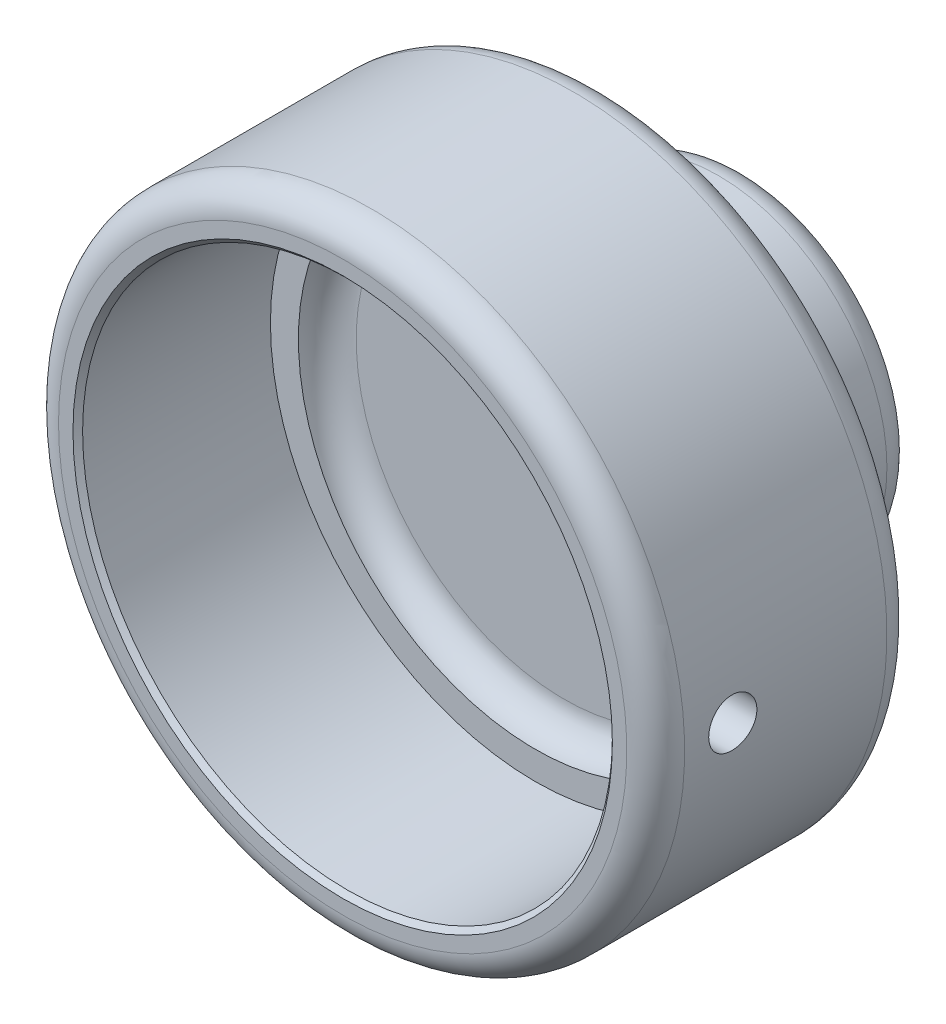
ISO-10303-21;
HEADER;
FILE_DESCRIPTION(('STEP AP214'),'2;1');
FILE_NAME('part.step','',(''),(''),'','','');
FILE_SCHEMA(('AUTOMOTIVE_DESIGN { 1 0 10303 214 1 1 1 1 }'));
ENDSEC;
DATA;
#1=APPLICATION_CONTEXT('core data for automotive mechanical design processes');
#2=APPLICATION_PROTOCOL_DEFINITION('international standard','automotive_design',2000,#1);
#3=PRODUCT_CONTEXT('',#1,'mechanical');
#4=PRODUCT('Part','Part','',(#3));
#5=PRODUCT_RELATED_PRODUCT_CATEGORY('part','',(#4));
#6=PRODUCT_DEFINITION_FORMATION('','',#4);
#7=PRODUCT_DEFINITION_CONTEXT('part definition',#1,'design');
#8=PRODUCT_DEFINITION('design','',#6,#7);
#9=PRODUCT_DEFINITION_SHAPE('','',#8);
#10=(LENGTH_UNIT() NAMED_UNIT(*) SI_UNIT(.MILLI.,.METRE.));
#11=(NAMED_UNIT(*) PLANE_ANGLE_UNIT() SI_UNIT($,.RADIAN.));
#12=(NAMED_UNIT(*) SI_UNIT($,.STERADIAN.) SOLID_ANGLE_UNIT());
#13=UNCERTAINTY_MEASURE_WITH_UNIT(LENGTH_MEASURE(1.E-05),#10,'distance_accuracy_value','');
#14=(GEOMETRIC_REPRESENTATION_CONTEXT(3) GLOBAL_UNCERTAINTY_ASSIGNED_CONTEXT((#13)) GLOBAL_UNIT_ASSIGNED_CONTEXT((#10,
#11,#12)) REPRESENTATION_CONTEXT('',''));
#15=CARTESIAN_POINT('',(0.,0.,0.));
#16=DIRECTION('',(0.,0.,1.));
#17=DIRECTION('',(1.,0.,0.));
#18=AXIS2_PLACEMENT_3D('',#15,#16,#17);
#19=CARTESIAN_POINT('',(0.,0.,56.3932145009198));
#20=DIRECTION('',(0.,0.,1.));
#21=DIRECTION('',(0.,-1.,0.));
#22=AXIS2_PLACEMENT_3D('',#19,#20,#21);
#23=CYLINDRICAL_SURFACE('',#22,27.5);
#24=CARTESIAN_POINT('',(0.,0.,21.9999999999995));
#25=DIRECTION('',(0.,0.,1.));
#26=DIRECTION('',(1.,0.,0.));
#27=AXIS2_PLACEMENT_3D('',#24,#25,#26);
#28=CIRCLE('',#27,27.5);
#29=CARTESIAN_POINT('',(27.5,0.,21.9999999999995));
#30=VERTEX_POINT('',#29);
#31=EDGE_CURVE('E139',#30,#30,#28,.T.);
#32=ORIENTED_EDGE('',*,*,#31,.F.);
#33=EDGE_LOOP('',(#32));
#34=FACE_BOUND('',#33,.T.);
#35=CARTESIAN_POINT('',(0.,0.,41.4999999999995));
#36=DIRECTION('',(0.,0.,-1.));
#37=DIRECTION('',(0.,1.,0.));
#38=AXIS2_PLACEMENT_3D('',#35,#36,#37);
#39=CIRCLE('',#38,27.5);
#40=CARTESIAN_POINT('',(0.,27.5,41.4999999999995));
#41=VERTEX_POINT('',#40);
#42=EDGE_CURVE('E154',#41,#41,#39,.F.);
#43=ORIENTED_EDGE('',*,*,#42,.T.);
#44=EDGE_LOOP('',(#43));
#45=FACE_BOUND('',#44,.T.);
#46=CARTESIAN_POINT('',(27.5,-1.94289029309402E-13,36.4999999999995));
#47=CARTESIAN_POINT('',(27.4999985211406,-0.140115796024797,36.4999939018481));
#48=CARTESIAN_POINT('',(27.4989177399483,-0.280325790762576,36.4881808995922));
#49=CARTESIAN_POINT('',(27.4947102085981,-0.556863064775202,36.4412323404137));
#50=CARTESIAN_POINT('',(27.4915811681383,-0.693185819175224,36.4060706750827));
#51=CARTESIAN_POINT('',(27.4836305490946,-0.957903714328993,36.3134529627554));
#52=CARTESIAN_POINT('',(27.4788099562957,-1.08630342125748,36.2560098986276));
#53=CARTESIAN_POINT('',(27.4680161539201,-1.33160898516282,36.1204840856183));
#54=CARTESIAN_POINT('',(27.462043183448,-1.44851721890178,36.0424056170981));
#55=CARTESIAN_POINT('',(27.4495943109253,-1.66790186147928,35.8675729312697));
#56=CARTESIAN_POINT('',(27.4431171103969,-1.77033896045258,35.770769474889));
#57=CARTESIAN_POINT('',(27.430400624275,-1.95753596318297,35.561339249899));
#58=CARTESIAN_POINT('',(27.4241613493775,-2.04229507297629,35.4487117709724));
#59=CARTESIAN_POINT('',(27.4126135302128,-2.19186610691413,35.2105887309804));
#60=CARTESIAN_POINT('',(27.4073066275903,-2.25664299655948,35.0850710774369));
#61=CARTESIAN_POINT('',(27.3982398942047,-2.36418706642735,34.8248842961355));
#62=CARTESIAN_POINT('',(27.394480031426,-2.40695470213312,34.6902153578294));
#63=CARTESIAN_POINT('',(27.3889444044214,-2.46915102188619,34.4159460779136));
#64=CARTESIAN_POINT('',(27.3871631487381,-2.48864431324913,34.2763605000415));
#65=CARTESIAN_POINT('',(27.3857692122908,-2.50393824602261,33.9958882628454));
#66=CARTESIAN_POINT('',(27.3861564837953,-2.49973940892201,33.8550016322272));
#67=CARTESIAN_POINT('',(27.3890508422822,-2.46782160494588,33.5763704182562));
#68=CARTESIAN_POINT('',(27.3915515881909,-2.4401729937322,33.4386177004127));
#69=CARTESIAN_POINT('',(27.398381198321,-2.36224986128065,33.1697161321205));
#70=CARTESIAN_POINT('',(27.4027100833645,-2.31197508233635,33.0385673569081));
#71=CARTESIAN_POINT('',(27.4127155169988,-2.19014843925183,32.7863731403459));
#72=CARTESIAN_POINT('',(27.4183940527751,-2.11856516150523,32.6653429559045));
#73=CARTESIAN_POINT('',(27.4304571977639,-1.95617612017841,32.4369884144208));
#74=CARTESIAN_POINT('',(27.4368418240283,-1.86536989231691,32.3296643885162));
#75=CARTESIAN_POINT('',(27.4496259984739,-1.66671871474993,32.1313597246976));
#76=CARTESIAN_POINT('',(27.4560255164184,-1.5588129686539,32.0404399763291));
#77=CARTESIAN_POINT('',(27.4680963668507,-1.32923747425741,31.8779960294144));
#78=CARTESIAN_POINT('',(27.4737676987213,-1.20756771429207,31.8064718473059));
#79=CARTESIAN_POINT('',(27.483744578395,-0.953877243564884,31.6848525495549));
#80=CARTESIAN_POINT('',(27.4880499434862,-0.821855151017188,31.6347603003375));
#81=CARTESIAN_POINT('',(27.494807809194,-0.551226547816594,31.5574702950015));
#82=CARTESIAN_POINT('',(27.4972603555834,-0.412620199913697,31.5302719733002));
#83=CARTESIAN_POINT('',(27.5000303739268,-0.133285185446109,31.4996186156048));
#84=CARTESIAN_POINT('',(27.5003554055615,0.00743418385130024,31.496079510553));
#85=CARTESIAN_POINT('',(27.4988539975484,0.287464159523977,31.5126245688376));
#86=CARTESIAN_POINT('',(27.497027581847,0.426774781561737,31.532708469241));
#87=CARTESIAN_POINT('',(27.4914334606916,0.699791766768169,31.595859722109));
#88=CARTESIAN_POINT('',(27.48766906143,0.833507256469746,31.6388879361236));
#89=CARTESIAN_POINT('',(27.4786216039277,1.09182141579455,31.7466663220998));
#90=CARTESIAN_POINT('',(27.4733385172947,1.21641991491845,31.8114169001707));
#91=CARTESIAN_POINT('',(27.4618265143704,1.4533447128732,31.9610120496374));
#92=CARTESIAN_POINT('',(27.4555950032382,1.56563584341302,32.0459121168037));
#93=CARTESIAN_POINT('',(27.4428944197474,1.77440294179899,32.2333163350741));
#94=CARTESIAN_POINT('',(27.436425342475,1.8708785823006,32.3358208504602));
#95=CARTESIAN_POINT('',(27.4239561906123,2.04556601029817,32.5558899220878));
#96=CARTESIAN_POINT('',(27.4179575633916,2.12372280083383,32.6734982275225));
#97=CARTESIAN_POINT('',(27.4071297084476,2.25917642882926,32.9202195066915));
#98=CARTESIAN_POINT('',(27.4023004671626,2.3164735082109,33.0493323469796));
#99=CARTESIAN_POINT('',(27.3943667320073,2.40848827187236,33.3152055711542));
#100=CARTESIAN_POINT('',(27.3912596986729,2.44323921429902,33.4519543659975));
#101=CARTESIAN_POINT('',(27.3871139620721,2.48928337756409,33.7293754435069));
#102=CARTESIAN_POINT('',(27.386075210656,2.50057714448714,33.8700476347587));
#103=CARTESIAN_POINT('',(27.3861844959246,2.49937951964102,34.1507757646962));
#104=CARTESIAN_POINT('',(27.3873245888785,2.48697452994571,34.2908320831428));
#105=CARTESIAN_POINT('',(27.3916462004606,2.43891212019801,34.5668629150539));
#106=CARTESIAN_POINT('',(27.394827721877,2.40325466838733,34.7028374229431));
#107=CARTESIAN_POINT('',(27.4028715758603,2.3097222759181,34.9668476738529));
#108=CARTESIAN_POINT('',(27.4077337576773,2.25184932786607,35.0948841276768));
#109=CARTESIAN_POINT('',(27.4185913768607,2.11553802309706,35.3394387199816));
#110=CARTESIAN_POINT('',(27.424586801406,2.03709989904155,35.4559569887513));
#111=CARTESIAN_POINT('',(27.4370614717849,1.86155995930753,35.674610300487));
#112=CARTESIAN_POINT('',(27.443542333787,1.76439393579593,35.7766937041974));
#113=CARTESIAN_POINT('',(27.4562428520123,1.55427847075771,35.9631476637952));
#114=CARTESIAN_POINT('',(27.4624624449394,1.441325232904,36.0475139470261));
#115=CARTESIAN_POINT('',(27.4739530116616,1.20258414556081,36.1962748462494));
#116=CARTESIAN_POINT('',(27.4792219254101,1.07676932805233,36.2606263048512));
#117=CARTESIAN_POINT('',(27.4881941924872,0.816155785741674,36.3672062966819));
#118=CARTESIAN_POINT('',(27.4918993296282,0.681367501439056,36.4094600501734));
#119=CARTESIAN_POINT('',(27.4963841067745,0.45483141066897,36.4599810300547));
#120=CARTESIAN_POINT('',(27.4977338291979,0.364536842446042,36.4749679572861));
#121=CARTESIAN_POINT('',(27.4995422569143,0.182841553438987,36.4949794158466));
#122=CARTESIAN_POINT('',(27.5000009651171,0.0914408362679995,36.5000039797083));
#123=CARTESIAN_POINT('',(27.5,-1.94289029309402E-13,36.4999999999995));
#124=B_SPLINE_CURVE_WITH_KNOTS('',3,(#46,#47,#48,#49,#50,#51,#52,#53,#54,#55,#56,#57,#58,#59,
#60,#61,#62,#63,#64,#65,#66,#67,#68,#69,#70,#71,#72,#73,#74,#75,#76,#77,#78,#79,#80,#81,#82,#83,
#84,#85,#86,#87,#88,#89,#90,#91,#92,#93,#94,#95,#96,#97,#98,#99,#100,#101,#102,#103,#104,#105,
#106,#107,#108,#109,#110,#111,#112,#113,#114,#115,#116,#117,#118,#119,#120,#121,#122,#123),
.UNSPECIFIED.,.T.,.F.,(4,2,2,2,2,2,2,2,2,2,2,2,2,2,2,2,2,2,2,2,2,2,2,2,2,2,2,2,2,2,2,2,2,2,2,2,
2,2,4),(0.,0.420013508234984,0.840497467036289,1.26073678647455,1.68088900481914,
2.10216145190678,2.52345281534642,2.94547867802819,3.36749580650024,3.78833871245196,
4.20917235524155,4.62874783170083,5.04832808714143,5.46852998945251,5.88874204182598,
6.31048311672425,6.73222454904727,7.15402236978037,7.57580976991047,7.99609761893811,
8.41638079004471,8.83594932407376,9.25552570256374,9.67627137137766,10.097025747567,
10.5190275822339,10.9410245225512,11.3623975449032,11.7837607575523,12.2035906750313,
12.6234211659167,13.0432140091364,13.4630021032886,13.8842558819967,14.3056111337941,
14.7278687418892,15.1496433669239,15.4237488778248,15.6978534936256),.UNSPECIFIED.);
#125=CARTESIAN_POINT('',(27.5,-1.94289029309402E-13,36.4999999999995));
#126=VERTEX_POINT('',#125);
#127=EDGE_CURVE('E69',#126,#126,#124,.T.);
#128=ORIENTED_EDGE('',*,*,#127,.T.);
#129=EDGE_LOOP('',(#128));
#130=FACE_BOUND('',#129,.T.);
#131=ADVANCED_FACE('F12',(#34,#45,#130),#23,.F.);
#132=CARTESIAN_POINT('',(0.,-1.94289029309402E-13,17.9999999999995));
#133=DIRECTION('',(0.,0.,-1.));
#134=DIRECTION('',(-1.,0.,0.));
#135=AXIS2_PLACEMENT_3D('',#132,#133,#134);
#136=CYLINDRICAL_SURFACE('',#135,32.5);
#137=CARTESIAN_POINT('',(0.,-1.94289029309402E-13,17.9999999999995));
#138=DIRECTION('',(0.,0.,-1.));
#139=DIRECTION('',(-1.,0.,0.));
#140=AXIS2_PLACEMENT_3D('',#137,#138,#139);
#141=CIRCLE('',#140,32.5);
#142=CARTESIAN_POINT('',(-32.5,-1.94289029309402E-13,17.9999999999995));
#143=VERTEX_POINT('',#142);
#144=EDGE_CURVE('E210',#143,#143,#141,.T.);
#145=ORIENTED_EDGE('',*,*,#144,.F.);
#146=EDGE_LOOP('',(#145));
#147=FACE_BOUND('',#146,.T.);
#148=CARTESIAN_POINT('',(0.,-1.94289029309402E-13,38.9999999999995));
#149=DIRECTION('',(0.,0.,-1.));
#150=DIRECTION('',(-1.,0.,0.));
#151=AXIS2_PLACEMENT_3D('',#148,#149,#150);
#152=CIRCLE('',#151,32.5);
#153=CARTESIAN_POINT('',(-32.5,-1.94289029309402E-13,38.9999999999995));
#154=VERTEX_POINT('',#153);
#155=EDGE_CURVE('E206',#154,#154,#152,.T.);
#156=ORIENTED_EDGE('',*,*,#155,.T.);
#157=EDGE_LOOP('',(#156));
#158=FACE_BOUND('',#157,.T.);
#159=CARTESIAN_POINT('',(32.5,-1.94289029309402E-13,36.4999999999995));
#160=CARTESIAN_POINT('',(32.4999987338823,0.14020372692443,36.4999938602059));
#161=CARTESIAN_POINT('',(32.4990830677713,0.280503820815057,36.4881660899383));
#162=CARTESIAN_POINT('',(32.4955183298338,0.557224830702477,36.4411554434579));
#163=CARTESIAN_POINT('',(32.4928672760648,0.693641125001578,36.4059458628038));
#164=CARTESIAN_POINT('',(32.4861314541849,0.958546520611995,36.3131934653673));
#165=CARTESIAN_POINT('',(32.4820474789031,1.08703995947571,36.2556629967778));
#166=CARTESIAN_POINT('',(32.4729042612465,1.33251463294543,36.1199233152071));
#167=CARTESIAN_POINT('',(32.4678452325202,1.44949838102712,36.041718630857));
#168=CARTESIAN_POINT('',(32.4573075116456,1.66892129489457,35.8666645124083));
#169=CARTESIAN_POINT('',(32.4518280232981,1.77133176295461,35.7697791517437));
#170=CARTESIAN_POINT('',(32.4410736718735,1.9584550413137,35.560189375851));
#171=CARTESIAN_POINT('',(32.4357988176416,2.04316708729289,35.4474842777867));
#172=CARTESIAN_POINT('',(32.4260421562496,2.19258379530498,35.2092833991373));
#173=CARTESIAN_POINT('',(32.4215613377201,2.25726358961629,35.0837719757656));
#174=CARTESIAN_POINT('',(32.413908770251,2.36462086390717,34.8236304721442));
#175=CARTESIAN_POINT('',(32.4107370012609,2.40729868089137,34.6890005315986));
#176=CARTESIAN_POINT('',(32.406068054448,2.46935819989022,34.4147284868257));
#177=CARTESIAN_POINT('',(32.4045675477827,2.48878621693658,34.275096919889));
#178=CARTESIAN_POINT('',(32.4034003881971,2.50393769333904,33.9945472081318));
#179=CARTESIAN_POINT('',(32.4037337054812,2.49966153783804,33.8536290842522));
#180=CARTESIAN_POINT('',(32.406193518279,2.46756437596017,33.5748231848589));
#181=CARTESIAN_POINT('',(32.4083161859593,2.43979362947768,33.436929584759));
#182=CARTESIAN_POINT('',(32.4141095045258,2.36157363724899,33.1677667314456));
#183=CARTESIAN_POINT('',(32.4177801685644,2.31112419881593,33.0364975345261));
#184=CARTESIAN_POINT('',(32.4262602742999,2.18892235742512,32.7841491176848));
#185=CARTESIAN_POINT('',(32.4310709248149,2.11714732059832,32.663080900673));
#186=CARTESIAN_POINT('',(32.4412877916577,1.9543480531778,32.4346914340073));
#187=CARTESIAN_POINT('',(32.4466940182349,1.86332349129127,32.3273704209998));
#188=CARTESIAN_POINT('',(32.4575098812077,1.66432673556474,32.1292295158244));
#189=CARTESIAN_POINT('',(32.4629194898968,1.55631107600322,32.0384532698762));
#190=CARTESIAN_POINT('',(32.4731191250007,1.32655017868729,31.8763158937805));
#191=CARTESIAN_POINT('',(32.4779091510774,1.20480493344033,31.8049547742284));
#192=CARTESIAN_POINT('',(32.486330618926,0.951013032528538,31.6836763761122));
#193=CARTESIAN_POINT('',(32.4899619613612,0.818965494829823,31.6337609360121));
#194=CARTESIAN_POINT('',(32.4956557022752,0.548329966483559,31.5568208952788));
#195=CARTESIAN_POINT('',(32.4977181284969,0.409742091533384,31.5297958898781));
#196=CARTESIAN_POINT('',(32.5000380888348,0.130338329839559,31.4994583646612));
#197=CARTESIAN_POINT('',(32.5003002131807,-0.0104709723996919,31.4960855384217));
#198=CARTESIAN_POINT('',(32.4990022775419,-0.290653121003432,31.5129902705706));
#199=CARTESIAN_POINT('',(32.4974422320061,-0.430025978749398,31.5332676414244));
#200=CARTESIAN_POINT('',(32.4926784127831,-0.703207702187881,31.5968472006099));
#201=CARTESIAN_POINT('',(32.4894766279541,-0.837023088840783,31.6401215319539));
#202=CARTESIAN_POINT('',(32.4817891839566,-1.0954930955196,31.7484382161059));
#203=CARTESIAN_POINT('',(32.4773035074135,-1.22014759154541,31.8134808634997));
#204=CARTESIAN_POINT('',(32.4675400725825,-1.4570323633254,31.9636400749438));
#205=CARTESIAN_POINT('',(32.4622607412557,-1.56923717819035,32.0487967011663));
#206=CARTESIAN_POINT('',(32.4515087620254,-1.77778073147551,32.2367085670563));
#207=CARTESIAN_POINT('',(32.4460361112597,-1.87411923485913,32.3394640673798));
#208=CARTESIAN_POINT('',(32.43550079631,-2.04840146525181,32.5599180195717));
#209=CARTESIAN_POINT('',(32.4304390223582,-2.12630591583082,32.677647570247));
#210=CARTESIAN_POINT('',(32.4213107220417,-2.26123953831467,32.9245524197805));
#211=CARTESIAN_POINT('',(32.417244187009,-2.31826889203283,33.0537276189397));
#212=CARTESIAN_POINT('',(32.410571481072,-2.40976618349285,33.3197164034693));
#213=CARTESIAN_POINT('',(32.4079637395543,-2.4442583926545,33.4565215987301));
#214=CARTESIAN_POINT('',(32.4044984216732,-2.48978139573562,33.7340024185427));
#215=CARTESIAN_POINT('',(32.4036408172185,-2.50081256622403,33.8746779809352));
#216=CARTESIAN_POINT('',(32.4037731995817,-2.49909627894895,34.1555159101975));
#217=CARTESIAN_POINT('',(32.4047583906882,-2.48641054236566,34.2956786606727));
#218=CARTESIAN_POINT('',(32.4084551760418,-2.43774899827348,34.5718769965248));
#219=CARTESIAN_POINT('',(32.4111667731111,-2.40177315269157,34.7079125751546));
#220=CARTESIAN_POINT('',(32.4180095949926,-2.30756771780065,34.9720006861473));
#221=CARTESIAN_POINT('',(32.422140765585,-2.24933897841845,35.1000535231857));
#222=CARTESIAN_POINT('',(32.4313572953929,-2.11228792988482,35.3445754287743));
#223=CARTESIAN_POINT('',(32.4364426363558,-2.03346601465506,35.4610447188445));
#224=CARTESIAN_POINT('',(32.4470101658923,-1.85723474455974,35.6794087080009));
#225=CARTESIAN_POINT('',(32.4524933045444,-1.75977991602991,35.7812666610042));
#226=CARTESIAN_POINT('',(32.4632300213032,-1.5491270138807,35.9672176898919));
#227=CARTESIAN_POINT('',(32.4684835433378,-1.43592512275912,36.0513064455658));
#228=CARTESIAN_POINT('',(32.4781771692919,-1.19680393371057,36.1994273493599));
#229=CARTESIAN_POINT('',(32.4826159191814,-1.07086399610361,36.2634262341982));
#230=CARTESIAN_POINT('',(32.4901633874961,-0.810079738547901,36.3692890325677));
#231=CARTESIAN_POINT('',(32.4932736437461,-0.67524592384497,36.4111785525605));
#232=CARTESIAN_POINT('',(32.4970095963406,-0.449672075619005,36.460890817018));
#233=CARTESIAN_POINT('',(32.4981259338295,-0.360385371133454,36.4755374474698));
#234=CARTESIAN_POINT('',(32.499621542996,-0.180745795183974,36.4950940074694));
#235=CARTESIAN_POINT('',(32.5000008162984,-0.0903929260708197,36.5000039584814));
#236=CARTESIAN_POINT('',(32.5,-1.94289029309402E-13,36.4999999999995));
#237=B_SPLINE_CURVE_WITH_KNOTS('',3,(#159,#160,#161,#162,#163,#164,#165,#166,#167,#168,#169,
#170,#171,#172,#173,#174,#175,#176,#177,#178,#179,#180,#181,#182,#183,#184,#185,#186,#187,#188,
#189,#190,#191,#192,#193,#194,#195,#196,#197,#198,#199,#200,#201,#202,#203,#204,#205,#206,#207,
#208,#209,#210,#211,#212,#213,#214,#215,#216,#217,#218,#219,#220,#221,#222,#223,#224,#225,#226,
#227,#228,#229,#230,#231,#232,#233,#234,#235,#236),.UNSPECIFIED.,.T.,.F.,(4,2,2,2,2,2,2,2,2,2,2,
2,2,2,2,2,2,2,2,2,2,2,2,2,2,2,2,2,2,2,2,2,2,2,2,2,2,2,4),(0.,0.420281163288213,
0.841043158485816,1.26157271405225,1.68201022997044,2.10326454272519,2.52453704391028,
2.94633042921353,3.36811735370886,3.78906264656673,4.21000109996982,4.63004134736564,
5.05008516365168,5.47057639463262,5.89107486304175,6.31266706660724,6.73425950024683,
7.1558880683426,7.57750918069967,7.99805488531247,8.41859725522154,8.83863136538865,
9.25867116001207,9.67955473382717,10.1004445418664,10.5222232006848,10.9439981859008,
11.3653181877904,11.7866314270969,12.2068497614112,12.6270687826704,13.0472717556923,
13.4674666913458,13.8887005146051,14.3100366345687,14.7320667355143,15.1536069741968,
15.4245735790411,15.6955395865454),.UNSPECIFIED.);
#238=CARTESIAN_POINT('',(32.5,-1.94289029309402E-13,36.4999999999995));
#239=VERTEX_POINT('',#238);
#240=EDGE_CURVE('E42',#239,#239,#237,.T.);
#241=ORIENTED_EDGE('',*,*,#240,.T.);
#242=EDGE_LOOP('',(#241));
#243=FACE_BOUND('',#242,.T.);
#244=ADVANCED_FACE('F80',(#147,#158,#243),#136,.T.);
#245=CARTESIAN_POINT('',(0.,-1.94289029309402E-13,52.8204584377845));
#246=DIRECTION('',(0.,0.,1.));
#247=DIRECTION('',(1.,0.,0.));
#248=AXIS2_PLACEMENT_3D('',#245,#246,#247);
#249=CYLINDRICAL_SURFACE('',#248,17.5);
#250=CARTESIAN_POINT('',(0.,-17.5,10.5));
#251=CARTESIAN_POINT('',(0.139663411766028,-17.499997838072,10.499994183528));
#252=CARTESIAN_POINT('',(0.279409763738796,-17.4983105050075,10.4882569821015));
#253=CARTESIAN_POINT('',(0.555001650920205,-17.4917417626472,10.441627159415));
#254=CARTESIAN_POINT('',(0.690843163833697,-17.4868571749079,10.406711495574));
#255=CARTESIAN_POINT('',(0.954596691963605,-17.4744432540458,10.3147848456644));
#256=CARTESIAN_POINT('',(1.08251442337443,-17.4669158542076,10.2577900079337));
#257=CARTESIAN_POINT('',(1.32694912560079,-17.4500497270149,10.1233611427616));
#258=CARTESIAN_POINT('',(1.44346778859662,-17.4407112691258,10.045930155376));
#259=CARTESIAN_POINT('',(1.66264662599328,-17.4211884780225,9.87223957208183));
#260=CARTESIAN_POINT('',(1.76521397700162,-17.4109991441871,9.77586339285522));
#261=CARTESIAN_POINT('',(1.95277822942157,-17.3909624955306,9.56726896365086));
#262=CARTESIAN_POINT('',(2.03777415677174,-17.3811151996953,9.4550498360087));
#263=CARTESIAN_POINT('',(2.18813969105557,-17.3628289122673,9.21733720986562));
#264=CARTESIAN_POINT('',(2.25342031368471,-17.3543963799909,9.09178688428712));
#265=CARTESIAN_POINT('',(2.36193362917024,-17.3399620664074,8.83136365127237));
#266=CARTESIAN_POINT('',(2.40516741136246,-17.3339601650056,8.6964912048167));
#267=CARTESIAN_POINT('',(2.46807330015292,-17.325115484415,8.42222497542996));
#268=CARTESIAN_POINT('',(2.48790372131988,-17.3222514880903,8.28286820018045));
#269=CARTESIAN_POINT('',(2.50393025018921,-17.3199423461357,8.00277773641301));
#270=CARTESIAN_POINT('',(2.50012759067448,-17.3204970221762,7.8620441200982));
#271=CARTESIAN_POINT('',(2.46912545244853,-17.3249431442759,7.58430863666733));
#272=CARTESIAN_POINT('',(2.44210170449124,-17.3288095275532,7.44728669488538));
#273=CARTESIAN_POINT('',(2.36569930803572,-17.3394042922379,7.17974228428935));
#274=CARTESIAN_POINT('',(2.31632008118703,-17.3461327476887,7.04921998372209));
#275=CARTESIAN_POINT('',(2.19642380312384,-17.3617214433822,6.79784181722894));
#276=CARTESIAN_POINT('',(2.12583173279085,-17.3705892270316,6.6770222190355));
#277=CARTESIAN_POINT('',(1.96556711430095,-17.3894518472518,6.44887696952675));
#278=CARTESIAN_POINT('',(1.87589342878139,-17.3994467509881,6.34155212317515));
#279=CARTESIAN_POINT('',(1.67904364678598,-17.4195483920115,6.14242399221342));
#280=CARTESIAN_POINT('',(1.57171634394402,-17.4296553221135,6.05077013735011));
#281=CARTESIAN_POINT('',(1.34312289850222,-17.44875794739,5.88675374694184));
#282=CARTESIAN_POINT('',(1.22185670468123,-17.4577536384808,5.81439128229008));
#283=CARTESIAN_POINT('',(0.968702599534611,-17.4736283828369,5.69100640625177));
#284=CARTESIAN_POINT('',(0.836809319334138,-17.4805063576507,5.63999486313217));
#285=CARTESIAN_POINT('',(0.566208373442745,-17.4913614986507,5.56088632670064));
#286=CARTESIAN_POINT('',(0.427501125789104,-17.4953388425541,5.53278792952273));
#287=CARTESIAN_POINT('',(0.148500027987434,-17.4999211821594,5.50050046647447));
#288=CARTESIAN_POINT('',(0.00823042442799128,-17.5005551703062,5.49610584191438));
#289=CARTESIAN_POINT('',(-0.271043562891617,-17.4984580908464,5.51080601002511));
#290=CARTESIAN_POINT('',(-0.41004798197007,-17.4957271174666,5.52990014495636));
#291=CARTESIAN_POINT('',(-0.682228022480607,-17.487224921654,5.59086492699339));
#292=CARTESIAN_POINT('',(-0.815426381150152,-17.4814669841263,5.63263607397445));
#293=CARTESIAN_POINT('',(-1.07292868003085,-17.4675546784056,5.73766467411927));
#294=CARTESIAN_POINT('',(-1.19723223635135,-17.4594002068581,5.80092305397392));
#295=CARTESIAN_POINT('',(-1.43432461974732,-17.4415297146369,5.94761727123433));
#296=CARTESIAN_POINT('',(-1.54703151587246,-17.4318036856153,6.03118428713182));
#297=CARTESIAN_POINT('',(-1.75689411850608,-17.4119055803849,6.21594009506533));
#298=CARTESIAN_POINT('',(-1.85404900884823,-17.401733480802,6.31712981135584));
#299=CARTESIAN_POINT('',(-2.03079205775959,-17.3819985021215,6.53517087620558));
#300=CARTESIAN_POINT('',(-2.11024287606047,-17.3724407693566,6.65213408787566));
#301=CARTESIAN_POINT('',(-2.24836960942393,-17.3551058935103,6.897866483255));
#302=CARTESIAN_POINT('',(-2.30704604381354,-17.3473287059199,7.02663537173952));
#303=CARTESIAN_POINT('',(-2.40174263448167,-17.3344721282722,7.29190413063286));
#304=CARTESIAN_POINT('',(-2.43783662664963,-17.3293839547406,7.42837719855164));
#305=CARTESIAN_POINT('',(-2.48657966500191,-17.3224576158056,7.70552570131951));
#306=CARTESIAN_POINT('',(-2.49923016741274,-17.3206192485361,7.8462008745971));
#307=CARTESIAN_POINT('',(-2.50069487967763,-17.3204077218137,8.12639228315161));
#308=CARTESIAN_POINT('',(-2.48972496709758,-17.3220031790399,8.26590741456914));
#309=CARTESIAN_POINT('',(-2.444721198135,-17.3284115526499,8.54108765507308));
#310=CARTESIAN_POINT('',(-2.41068736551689,-17.3332244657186,8.67675276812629));
#311=CARTESIAN_POINT('',(-2.32059556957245,-17.3455148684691,8.94033158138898));
#312=CARTESIAN_POINT('',(-2.26455128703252,-17.3529907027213,9.0682500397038));
#313=CARTESIAN_POINT('',(-2.13205080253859,-17.3697668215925,9.31290305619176));
#314=CARTESIAN_POINT('',(-2.05559403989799,-17.3790671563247,9.42963730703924));
#315=CARTESIAN_POINT('',(-1.88364934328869,-17.3985457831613,9.64970727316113));
#316=CARTESIAN_POINT('',(-1.78800116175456,-17.4087310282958,9.75291718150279));
#317=CARTESIAN_POINT('',(-1.58072689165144,-17.428772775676,9.94189963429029));
#318=CARTESIAN_POINT('',(-1.46909708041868,-17.4386292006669,10.0276681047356));
#319=CARTESIAN_POINT('',(-1.23237928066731,-17.4569582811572,10.1797094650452));
#320=CARTESIAN_POINT('',(-1.10722714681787,-17.4654238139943,10.2458833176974));
#321=CARTESIAN_POINT('',(-0.847526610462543,-17.4799469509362,10.3561746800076));
#322=CARTESIAN_POINT('',(-0.712988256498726,-17.4860070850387,10.4003153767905));
#323=CARTESIAN_POINT('',(-0.481514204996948,-17.4936295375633,10.4551044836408));
#324=CARTESIAN_POINT('',(-0.386017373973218,-17.496006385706,10.4719150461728));
#325=CARTESIAN_POINT('',(-0.19369365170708,-17.4991923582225,10.4943647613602));
#326=CARTESIAN_POINT('',(-0.0968667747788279,-17.5000014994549,10.5000040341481));
#327=CARTESIAN_POINT('',(0.,-17.5,10.5));
#328=B_SPLINE_CURVE_WITH_KNOTS('',3,(#250,#251,#252,#253,#254,#255,#256,#257,#258,#259,#260,
#261,#262,#263,#264,#265,#266,#267,#268,#269,#270,#271,#272,#273,#274,#275,#276,#277,#278,#279,
#280,#281,#282,#283,#284,#285,#286,#287,#288,#289,#290,#291,#292,#293,#294,#295,#296,#297,#298,
#299,#300,#301,#302,#303,#304,#305,#306,#307,#308,#309,#310,#311,#312,#313,#314,#315,#316,#317,
#318,#319,#320,#321,#322,#323,#324,#325,#326,#327),.UNSPECIFIED.,.T.,.F.,(4,2,2,2,2,2,2,2,2,2,2,
2,2,2,2,2,2,2,2,2,2,2,2,2,2,2,2,2,2,2,2,2,2,2,2,2,2,2,4),(0.,0.418636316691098,
0.837689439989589,1.25643665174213,1.67512160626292,2.09646858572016,2.51783891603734,
2.94108360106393,3.36430737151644,3.78465148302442,4.20497366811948,4.62214270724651,
5.03932253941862,5.45799544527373,5.87669331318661,6.2991844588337,6.72167715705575,
7.14438465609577,7.5670662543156,7.98607640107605,8.40507481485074,8.82224947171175,
9.23944212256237,9.65940469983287,10.0793893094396,10.5025265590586,10.9256532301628,
11.3473891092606,11.7690987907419,12.186970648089,12.6048420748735,13.0224541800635,
13.4400777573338,13.8613455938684,14.2827117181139,14.7061725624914,15.1291868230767,
15.419544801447,15.7098996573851),.UNSPECIFIED.);
#329=CARTESIAN_POINT('',(0.,-17.5,10.5));
#330=VERTEX_POINT('',#329);
#331=EDGE_CURVE('E41',#330,#330,#328,.T.);
#332=ORIENTED_EDGE('',*,*,#331,.T.);
#333=EDGE_LOOP('',(#332));
#334=FACE_BOUND('',#333,.T.);
#335=CARTESIAN_POINT('',(0.,-1.94289029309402E-13,11.9999999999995));
#336=DIRECTION('',(0.,0.,1.));
#337=DIRECTION('',(1.,0.,0.));
#338=AXIS2_PLACEMENT_3D('',#335,#336,#337);
#339=CIRCLE('',#338,17.5);
#340=CARTESIAN_POINT('',(17.5,-1.94289029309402E-13,11.9999999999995));
#341=VERTEX_POINT('',#340);
#342=EDGE_CURVE('E142',#341,#341,#339,.T.);
#343=ORIENTED_EDGE('',*,*,#342,.F.);
#344=EDGE_LOOP('',(#343));
#345=FACE_BOUND('',#344,.T.);
#346=CARTESIAN_POINT('',(0.,-1.94289029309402E-13,3.));
#347=DIRECTION('',(0.,0.,1.));
#348=DIRECTION('',(1.,0.,0.));
#349=AXIS2_PLACEMENT_3D('',#346,#347,#348);
#350=CIRCLE('',#349,17.5);
#351=CARTESIAN_POINT('',(17.5,-1.94289029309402E-13,3.));
#352=VERTEX_POINT('',#351);
#353=EDGE_CURVE('E138',#352,#352,#350,.T.);
#354=ORIENTED_EDGE('',*,*,#353,.T.);
#355=EDGE_LOOP('',(#354));
#356=FACE_BOUND('',#355,.T.);
#357=CARTESIAN_POINT('',(17.5,-1.94289029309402E-13,5.5));
#358=CARTESIAN_POINT('',(17.4999978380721,0.139663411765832,5.50000581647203));
#359=CARTESIAN_POINT('',(17.4983105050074,0.279409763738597,5.5117430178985));
#360=CARTESIAN_POINT('',(17.4917417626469,0.555001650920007,5.55837284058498));
#361=CARTESIAN_POINT('',(17.4868571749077,0.690843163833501,5.59328850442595));
#362=CARTESIAN_POINT('',(17.4744432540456,0.95459669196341,5.68521515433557));
#363=CARTESIAN_POINT('',(17.4669158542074,1.08251442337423,5.74220999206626));
#364=CARTESIAN_POINT('',(17.4500497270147,1.3269491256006,5.87663885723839));
#365=CARTESIAN_POINT('',(17.4407112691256,1.44346778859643,5.95406984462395));
#366=CARTESIAN_POINT('',(17.4211884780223,1.66264662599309,6.12776042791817));
#367=CARTESIAN_POINT('',(17.4109991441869,1.76521397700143,6.22413660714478));
#368=CARTESIAN_POINT('',(17.3909624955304,1.95277822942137,6.43273103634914));
#369=CARTESIAN_POINT('',(17.3811151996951,2.03777415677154,6.5449501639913));
#370=CARTESIAN_POINT('',(17.3628289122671,2.18813969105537,6.78266279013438));
#371=CARTESIAN_POINT('',(17.3543963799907,2.25342031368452,6.90821311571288));
#372=CARTESIAN_POINT('',(17.3399620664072,2.36193362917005,7.16863634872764));
#373=CARTESIAN_POINT('',(17.3339601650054,2.40516741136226,7.30350879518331));
#374=CARTESIAN_POINT('',(17.3251154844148,2.46807330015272,7.57777502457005));
#375=CARTESIAN_POINT('',(17.3222514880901,2.48790372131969,7.71713179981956));
#376=CARTESIAN_POINT('',(17.3199423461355,2.50393025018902,7.997222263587));
#377=CARTESIAN_POINT('',(17.320497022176,2.50012759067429,8.13795587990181));
#378=CARTESIAN_POINT('',(17.3249431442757,2.46912545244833,8.41569136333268));
#379=CARTESIAN_POINT('',(17.328809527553,2.44210170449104,8.55271330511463));
#380=CARTESIAN_POINT('',(17.3394042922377,2.36569930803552,8.82025771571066));
#381=CARTESIAN_POINT('',(17.3461327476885,2.31632008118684,8.95078001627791));
#382=CARTESIAN_POINT('',(17.361721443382,2.19642380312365,9.20215818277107));
#383=CARTESIAN_POINT('',(17.3705892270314,2.12583173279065,9.32297778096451));
#384=CARTESIAN_POINT('',(17.3894518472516,1.96556711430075,9.55112303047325));
#385=CARTESIAN_POINT('',(17.3994467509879,1.87589342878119,9.65844787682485));
#386=CARTESIAN_POINT('',(17.4195483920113,1.67904364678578,9.85757600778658));
#387=CARTESIAN_POINT('',(17.4296553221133,1.57171634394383,9.9492298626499));
#388=CARTESIAN_POINT('',(17.4487579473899,1.34312289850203,10.1132462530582));
#389=CARTESIAN_POINT('',(17.4577536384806,1.22185670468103,10.1856087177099));
#390=CARTESIAN_POINT('',(17.4736283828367,0.968702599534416,10.3089935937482));
#391=CARTESIAN_POINT('',(17.4805063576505,0.836809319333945,10.3600051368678));
#392=CARTESIAN_POINT('',(17.4913614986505,0.566208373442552,10.4391136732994));
#393=CARTESIAN_POINT('',(17.4953388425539,0.427501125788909,10.4672120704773));
#394=CARTESIAN_POINT('',(17.4999211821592,0.148500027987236,10.4994995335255));
#395=CARTESIAN_POINT('',(17.500555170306,0.00823042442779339,10.5038941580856));
#396=CARTESIAN_POINT('',(17.4984580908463,-0.271043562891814,10.4891939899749));
#397=CARTESIAN_POINT('',(17.4957271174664,-0.410047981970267,10.4700998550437));
#398=CARTESIAN_POINT('',(17.4872249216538,-0.682228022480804,10.4091350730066));
#399=CARTESIAN_POINT('',(17.4814669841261,-0.815426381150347,10.3673639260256));
#400=CARTESIAN_POINT('',(17.4675546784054,-1.07292868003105,10.2623353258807));
#401=CARTESIAN_POINT('',(17.4594002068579,-1.19723223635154,10.1990769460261));
#402=CARTESIAN_POINT('',(17.4415297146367,-1.43432461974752,10.0523827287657));
#403=CARTESIAN_POINT('',(17.4318036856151,-1.54703151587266,9.96881571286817));
#404=CARTESIAN_POINT('',(17.4119055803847,-1.75689411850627,9.78405990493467));
#405=CARTESIAN_POINT('',(17.4017334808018,-1.85404900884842,9.68287018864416));
#406=CARTESIAN_POINT('',(17.3819985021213,-2.03079205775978,9.46482912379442));
#407=CARTESIAN_POINT('',(17.3724407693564,-2.11024287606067,9.34786591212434));
#408=CARTESIAN_POINT('',(17.3551058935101,-2.24836960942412,9.102133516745));
#409=CARTESIAN_POINT('',(17.3473287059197,-2.30704604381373,8.97336462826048));
#410=CARTESIAN_POINT('',(17.334472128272,-2.40174263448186,8.70809586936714));
#411=CARTESIAN_POINT('',(17.3293839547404,-2.43783662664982,8.57162280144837));
#412=CARTESIAN_POINT('',(17.3224576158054,-2.48657966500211,8.29447429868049));
#413=CARTESIAN_POINT('',(17.3206192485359,-2.49923016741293,8.1537991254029));
#414=CARTESIAN_POINT('',(17.3204077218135,-2.50069487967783,7.87360771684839));
#415=CARTESIAN_POINT('',(17.3220031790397,-2.48972496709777,7.73409258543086));
#416=CARTESIAN_POINT('',(17.3284115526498,-2.44472119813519,7.45891234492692));
#417=CARTESIAN_POINT('',(17.3332244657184,-2.41068736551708,7.32324723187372));
#418=CARTESIAN_POINT('',(17.3455148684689,-2.32059556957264,7.05966841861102));
#419=CARTESIAN_POINT('',(17.3529907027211,-2.26455128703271,6.9317499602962));
#420=CARTESIAN_POINT('',(17.3697668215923,-2.13205080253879,6.68709694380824));
#421=CARTESIAN_POINT('',(17.3790671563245,-2.05559403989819,6.57036269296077));
#422=CARTESIAN_POINT('',(17.3985457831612,-1.88364934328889,6.35029272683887));
#423=CARTESIAN_POINT('',(17.4087310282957,-1.78800116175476,6.24708281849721));
#424=CARTESIAN_POINT('',(17.4287727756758,-1.58072689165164,6.05810036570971));
#425=CARTESIAN_POINT('',(17.4386292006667,-1.46909708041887,5.97233189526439));
#426=CARTESIAN_POINT('',(17.456958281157,-1.2323792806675,5.82029053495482));
#427=CARTESIAN_POINT('',(17.4654238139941,-1.10722714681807,5.75411668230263));
#428=CARTESIAN_POINT('',(17.4799469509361,-0.847526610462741,5.64382531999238));
#429=CARTESIAN_POINT('',(17.4860070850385,-0.71298825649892,5.59968462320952));
#430=CARTESIAN_POINT('',(17.4936295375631,-0.48151420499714,5.54489551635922));
#431=CARTESIAN_POINT('',(17.4960063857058,-0.38601737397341,5.5280849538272));
#432=CARTESIAN_POINT('',(17.4991923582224,-0.193693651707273,5.50563523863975));
#433=CARTESIAN_POINT('',(17.5000014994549,-0.0968667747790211,5.49999596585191));
#434=CARTESIAN_POINT('',(17.5,-1.94289029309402E-13,5.5));
#435=B_SPLINE_CURVE_WITH_KNOTS('',3,(#357,#358,#359,#360,#361,#362,#363,#364,#365,#366,#367,
#368,#369,#370,#371,#372,#373,#374,#375,#376,#377,#378,#379,#380,#381,#382,#383,#384,#385,#386,
#387,#388,#389,#390,#391,#392,#393,#394,#395,#396,#397,#398,#399,#400,#401,#402,#403,#404,#405,
#406,#407,#408,#409,#410,#411,#412,#413,#414,#415,#416,#417,#418,#419,#420,#421,#422,#423,#424,
#425,#426,#427,#428,#429,#430,#431,#432,#433,#434),.UNSPECIFIED.,.T.,.F.,(4,2,2,2,2,2,2,2,2,2,2,
2,2,2,2,2,2,2,2,2,2,2,2,2,2,2,2,2,2,2,2,2,2,2,2,2,2,2,4),(0.,0.418636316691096,
0.837689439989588,1.25643665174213,1.67512160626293,2.09646858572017,2.51783891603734,
2.94108360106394,3.36430737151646,3.78465148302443,4.20497366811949,4.62214270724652,
5.03932253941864,5.45799544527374,5.87669331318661,6.29918445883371,6.72167715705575,
7.14438465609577,7.5670662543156,7.98607640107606,8.40507481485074,8.82224947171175,
9.23944212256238,9.65940469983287,10.0793893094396,10.5025265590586,10.9256532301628,
11.3473891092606,11.7690987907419,12.186970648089,12.6048420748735,13.0224541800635,
13.4400777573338,13.8613455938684,14.2827117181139,14.7061725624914,15.1291868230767,
15.419544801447,15.7098996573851),.UNSPECIFIED.);
#436=CARTESIAN_POINT('',(17.5,-1.94289029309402E-13,5.5));
#437=VERTEX_POINT('',#436);
#438=EDGE_CURVE('E40',#437,#437,#435,.T.);
#439=ORIENTED_EDGE('',*,*,#438,.F.);
#440=EDGE_LOOP('',(#439));
#441=FACE_BOUND('',#440,.T.);
#442=ADVANCED_FACE('F75',(#334,#345,#356,#441),#249,.T.);
#443=CARTESIAN_POINT('',(0.,0.,42.0009999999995));
#444=DIRECTION('',(0.,0.,-1.));
#445=DIRECTION('',(-1.,0.,0.));
#446=AXIS2_PLACEMENT_3D('',#443,#444,#445);
#447=CYLINDRICAL_SURFACE('',#446,4.);
#448=CARTESIAN_POINT('',(0.,-4.,10.5));
#449=CARTESIAN_POINT('',(-0.127017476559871,-3.99999041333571,10.4999895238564));
#450=CARTESIAN_POINT('',(-0.254191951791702,-3.9938860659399,10.4902535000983));
#451=CARTESIAN_POINT('',(-0.504637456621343,-3.97004375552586,10.4518288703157));
#452=CARTESIAN_POINT('',(-0.627900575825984,-3.95228361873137,10.4231041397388));
#453=CARTESIAN_POINT('',(-0.866410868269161,-3.90691695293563,10.3483771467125));
#454=CARTESIAN_POINT('',(-0.981694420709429,-3.87935918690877,10.3024603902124));
#455=CARTESIAN_POINT('',(-1.20252080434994,-3.81669199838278,10.1952283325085));
#456=CARTESIAN_POINT('',(-1.30806471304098,-3.7815834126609,10.1339147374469));
#457=CARTESIAN_POINT('',(-1.51594836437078,-3.70340304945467,9.9922268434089));
#458=CARTESIAN_POINT('',(-1.61735911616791,-3.65991924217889,9.91072139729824));
#459=CARTESIAN_POINT('',(-1.80597275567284,-3.57062700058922,9.73356165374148));
#460=CARTESIAN_POINT('',(-1.89315621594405,-3.52481549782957,9.63788834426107));
#461=CARTESIAN_POINT('',(-2.06285746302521,-3.42860837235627,9.4199322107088));
#462=CARTESIAN_POINT('',(-2.14314412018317,-3.37843221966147,9.29580042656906));
#463=CARTESIAN_POINT('',(-2.28147932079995,-3.28660396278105,9.03287036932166));
#464=CARTESIAN_POINT('',(-2.33956541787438,-3.2449375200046,8.89409737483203));
#465=CARTESIAN_POINT('',(-2.41866801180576,-3.18619151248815,8.6423789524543));
#466=CARTESIAN_POINT('',(-2.44539104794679,-3.16553811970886,8.53206636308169));
#467=CARTESIAN_POINT('',(-2.4836368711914,-3.1356271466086,8.30738814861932));
#468=CARTESIAN_POINT('',(-2.49518112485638,-3.12635347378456,8.19302848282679));
#469=CARTESIAN_POINT('',(-2.50237836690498,-3.12059771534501,7.96317396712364));
#470=CARTESIAN_POINT('',(-2.49798968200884,-3.12414917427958,7.84767692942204));
#471=CARTESIAN_POINT('',(-2.47352633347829,-3.14354804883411,7.61937979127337));
#472=CARTESIAN_POINT('',(-2.45343909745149,-3.15940531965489,7.50658192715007));
#473=CARTESIAN_POINT('',(-2.3993620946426,-3.20065145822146,7.2891231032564));
#474=CARTESIAN_POINT('',(-2.36570043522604,-3.22581428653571,7.18433512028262));
#475=CARTESIAN_POINT('',(-2.28580369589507,-3.28291134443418,6.98167760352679));
#476=CARTESIAN_POINT('',(-2.2395641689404,-3.31484796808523,6.88381053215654));
#477=CARTESIAN_POINT('',(-2.12589830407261,-3.38909625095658,6.67833359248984));
#478=CARTESIAN_POINT('',(-2.05612773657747,-3.4322315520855,6.57231894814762));
#479=CARTESIAN_POINT('',(-1.90176111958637,-3.52011451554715,6.3723388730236));
#480=CARTESIAN_POINT('',(-1.81714983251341,-3.56486379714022,6.27838599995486));
#481=CARTESIAN_POINT('',(-1.61904732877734,-3.65959667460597,6.08939899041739));
#482=CARTESIAN_POINT('',(-1.50309447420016,-3.70922571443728,5.9967440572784));
#483=CARTESIAN_POINT('',(-1.25426444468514,-3.8005660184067,5.83228820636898));
#484=CARTESIAN_POINT('',(-1.12139395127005,-3.84228039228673,5.76047909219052));
#485=CARTESIAN_POINT('',(-0.915775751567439,-3.89435975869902,5.67265404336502));
#486=CARTESIAN_POINT('',(-0.84819358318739,-3.90966874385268,5.6471657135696));
#487=CARTESIAN_POINT('',(-0.710492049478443,-3.93701839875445,5.60199234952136));
#488=CARTESIAN_POINT('',(-0.640374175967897,-3.94906095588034,5.58230396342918));
#489=CARTESIAN_POINT('',(-0.49823901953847,-3.96949699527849,5.54906583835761));
#490=CARTESIAN_POINT('',(-0.426223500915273,-3.97789374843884,5.535510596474));
#491=CARTESIAN_POINT('',(-0.280965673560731,-3.99078766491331,5.51475370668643));
#492=CARTESIAN_POINT('',(-0.20772357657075,-3.99528549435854,5.5075509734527));
#493=CARTESIAN_POINT('',(-0.00911917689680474,-4.00193773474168,5.49689069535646));
#494=CARTESIAN_POINT('',(0.116782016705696,-4.000238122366,5.49959963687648));
#495=CARTESIAN_POINT('',(0.365967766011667,-3.98518313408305,5.52375966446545));
#496=CARTESIAN_POINT('',(0.489252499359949,-3.97182855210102,5.54520947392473));
#497=CARTESIAN_POINT('',(0.725036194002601,-3.93547975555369,5.60447858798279));
#498=CARTESIAN_POINT('',(0.837768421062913,-3.91288306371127,5.64162472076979));
#499=CARTESIAN_POINT('',(1.05527816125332,-3.85991402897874,5.73059237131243));
#500=CARTESIAN_POINT('',(1.16005433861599,-3.82954038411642,5.78241634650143));
#501=CARTESIAN_POINT('',(1.37016761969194,-3.75980014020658,5.90503053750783));
#502=CARTESIAN_POINT('',(1.47449380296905,-3.71983526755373,5.97720717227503));
#503=CARTESIAN_POINT('',(1.67028541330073,-3.63613942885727,6.13558769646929));
#504=CARTESIAN_POINT('',(1.76173634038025,-3.59240430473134,6.22180716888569));
#505=CARTESIAN_POINT('',(1.94294835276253,-3.49811738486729,6.42027008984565));
#506=CARTESIAN_POINT('',(2.03053702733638,-3.44749766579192,6.53447441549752));
#507=CARTESIAN_POINT('',(2.18560704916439,-3.35133525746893,6.77775156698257));
#508=CARTESIAN_POINT('',(2.25310231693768,-3.30578906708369,6.90681401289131));
#509=CARTESIAN_POINT('',(2.35369543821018,-3.23467060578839,7.14938429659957));
#510=CARTESIAN_POINT('',(2.39103791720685,-3.20691272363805,7.2604815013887));
#511=CARTESIAN_POINT('',(2.45000216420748,-3.16210061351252,7.48878629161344));
#512=CARTESIAN_POINT('',(2.47164849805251,-3.1450296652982,7.60598401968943));
#513=CARTESIAN_POINT('',(2.49802767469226,-3.12412649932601,7.84418055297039));
#514=CARTESIAN_POINT('',(2.50266374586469,-3.12037003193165,7.96519716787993));
#515=CARTESIAN_POINT('',(2.49439556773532,-3.12698126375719,8.20626192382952));
#516=CARTESIAN_POINT('',(2.48148548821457,-3.13735365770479,8.32630972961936));
#517=CARTESIAN_POINT('',(2.44076547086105,-3.16910777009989,8.55205957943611));
#518=CARTESIAN_POINT('',(2.41423847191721,-3.18953614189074,8.65813856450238));
#519=CARTESIAN_POINT('',(2.34835238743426,-3.23835062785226,8.86427015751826));
#520=CARTESIAN_POINT('',(2.30898795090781,-3.26674005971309,8.96432023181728));
#521=CARTESIAN_POINT('',(2.21205415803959,-3.33327797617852,9.17119332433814));
#522=CARTESIAN_POINT('',(2.15267427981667,-3.3722442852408,9.27689994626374));
#523=CARTESIAN_POINT('',(2.01999894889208,-3.45335445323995,9.47787738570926));
#524=CARTESIAN_POINT('',(1.94669224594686,-3.49550086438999,9.57313966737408));
#525=CARTESIAN_POINT('',(1.77134669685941,-3.58803675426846,9.77002558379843));
#526=CARTESIAN_POINT('',(1.66649284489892,-3.63840488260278,9.86916976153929));
#527=CARTESIAN_POINT('',(1.43961937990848,-3.7339805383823,10.0490015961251));
#528=CARTESIAN_POINT('',(1.3175892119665,-3.77918486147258,10.1296778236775));
#529=CARTESIAN_POINT('',(1.1234635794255,-3.83959214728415,10.2345634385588));
#530=CARTESIAN_POINT('',(1.05679601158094,-3.85851834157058,10.266874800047));
#531=CARTESIAN_POINT('',(0.920199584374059,-3.89335165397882,10.3256722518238));
#532=CARTESIAN_POINT('',(0.850272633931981,-3.9092605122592,10.3521617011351));
#533=CARTESIAN_POINT('',(0.707873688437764,-3.93753374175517,10.3988571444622));
#534=CARTESIAN_POINT('',(0.635409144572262,-3.94990764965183,10.4190800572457));
#535=CARTESIAN_POINT('',(0.488456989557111,-3.97075677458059,10.4529754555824));
#536=CARTESIAN_POINT('',(0.413970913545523,-3.97923486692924,10.4666527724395));
#537=CARTESIAN_POINT('',(0.282852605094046,-3.99038271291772,10.4845904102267));
#538=CARTESIAN_POINT('',(0.226501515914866,-3.99398159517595,10.4903615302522));
#539=CARTESIAN_POINT('',(0.113444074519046,-3.99879245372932,10.4980687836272));
#540=CARTESIAN_POINT('',(0.056737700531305,-4.00000428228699,10.5000046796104));
#541=CARTESIAN_POINT('',(0.,-4.,10.5));
#542=B_SPLINE_CURVE_WITH_KNOTS('',3,(#448,#449,#450,#451,#452,#453,#454,#455,#456,#457,#458,
#459,#460,#461,#462,#463,#464,#465,#466,#467,#468,#469,#470,#471,#472,#473,#474,#475,#476,#477,
#478,#479,#480,#481,#482,#483,#484,#485,#486,#487,#488,#489,#490,#491,#492,#493,#494,#495,#496,
#497,#498,#499,#500,#501,#502,#503,#504,#505,#506,#507,#508,#509,#510,#511,#512,#513,#514,#515,
#516,#517,#518,#519,#520,#521,#522,#523,#524,#525,#526,#527,#528,#529,#530,#531,#532,#533,#534,
#535,#536,#537,#538,#539,#540,#541),.UNSPECIFIED.,.T.,.F.,(4,2,2,2,2,2,2,2,2,2,2,2,2,2,2,2,2,2,
2,2,2,2,2,2,2,2,2,2,2,2,2,2,2,2,2,2,2,2,2,2,2,2,2,2,2,2,4),(0.,0.380824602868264,
0.762375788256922,1.14205397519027,1.52169010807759,1.93164374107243,2.34215256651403,
2.80825951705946,3.2735744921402,3.61824017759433,3.96241789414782,4.30749646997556,
4.65285169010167,4.99031678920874,5.32790135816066,5.7285490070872,6.12961045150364,
6.59684361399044,7.06389281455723,7.28510978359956,7.50619865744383,7.72708876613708,
7.94794112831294,8.32363778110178,8.69930884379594,9.0602842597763,9.42132014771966,
9.81879878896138,10.216721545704,10.6724083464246,11.1277787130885,11.4876929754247,
11.8470427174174,12.2084336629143,12.5699447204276,12.9023575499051,13.2349091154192,
13.6156046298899,13.9966089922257,14.4531049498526,14.9098826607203,15.1389848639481,
15.3679545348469,15.5963005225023,15.8244777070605,15.994578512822,16.1646898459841),.UNSPECIFIED.);
#543=CARTESIAN_POINT('',(0.,-4.,10.5));
#544=VERTEX_POINT('',#543);
#545=EDGE_CURVE('E16',#544,#544,#542,.T.);
#546=ORIENTED_EDGE('',*,*,#545,.T.);
#547=EDGE_LOOP('',(#546));
#548=FACE_BOUND('',#547,.T.);
#549=CARTESIAN_POINT('',(0.,0.,0.499999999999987));
#550=DIRECTION('',(0.,0.,-1.));
#551=DIRECTION('',(-1.,0.,0.));
#552=AXIS2_PLACEMENT_3D('',#549,#550,#551);
#553=CIRCLE('',#552,4.);
#554=CARTESIAN_POINT('',(-4.,0.,0.499999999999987));
#555=VERTEX_POINT('',#554);
#556=EDGE_CURVE('E30',#555,#555,#553,.T.);
#557=ORIENTED_EDGE('',*,*,#556,.T.);
#558=EDGE_LOOP('',(#557));
#559=FACE_BOUND('',#558,.T.);
#560=CARTESIAN_POINT('',(0.,0.,18.4999999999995));
#561=DIRECTION('',(0.,0.,1.));
#562=DIRECTION('',(1.,0.,0.));
#563=AXIS2_PLACEMENT_3D('',#560,#561,#562);
#564=CIRCLE('',#563,4.);
#565=CARTESIAN_POINT('',(4.,0.,18.4999999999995));
#566=VERTEX_POINT('',#565);
#567=EDGE_CURVE('E163',#566,#566,#564,.T.);
#568=ORIENTED_EDGE('',*,*,#567,.T.);
#569=EDGE_LOOP('',(#568));
#570=FACE_BOUND('',#569,.T.);
#571=CARTESIAN_POINT('',(4.,-1.94289029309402E-13,10.5));
#572=CARTESIAN_POINT('',(3.99999041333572,0.127017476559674,10.4999895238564));
#573=CARTESIAN_POINT('',(3.99388606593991,0.254191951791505,10.4902535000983));
#574=CARTESIAN_POINT('',(3.97004375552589,0.504637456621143,10.4518288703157));
#575=CARTESIAN_POINT('',(3.95228361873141,0.627900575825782,10.4231041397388));
#576=CARTESIAN_POINT('',(3.90691695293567,0.866410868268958,10.3483771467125));
#577=CARTESIAN_POINT('',(3.87935918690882,0.981694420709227,10.3024603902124));
#578=CARTESIAN_POINT('',(3.81669199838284,1.20252080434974,10.1952283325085));
#579=CARTESIAN_POINT('',(3.78158341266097,1.30806471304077,10.1339147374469));
#580=CARTESIAN_POINT('',(3.70340304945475,1.51594836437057,9.9922268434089));
#581=CARTESIAN_POINT('',(3.65991924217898,1.6173591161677,9.91072139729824));
#582=CARTESIAN_POINT('',(3.57062700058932,1.80597275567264,9.73356165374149));
#583=CARTESIAN_POINT('',(3.52481549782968,1.89315621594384,9.63788834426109));
#584=CARTESIAN_POINT('',(3.42860837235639,2.062857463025,9.41993221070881));
#585=CARTESIAN_POINT('',(3.3784322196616,2.14314412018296,9.29580042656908));
#586=CARTESIAN_POINT('',(3.28660396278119,2.28147932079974,9.03287036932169));
#587=CARTESIAN_POINT('',(3.24493752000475,2.33956541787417,8.89409737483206));
#588=CARTESIAN_POINT('',(3.1861915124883,2.41866801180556,8.64237895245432));
#589=CARTESIAN_POINT('',(3.16553811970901,2.44539104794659,8.53206636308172));
#590=CARTESIAN_POINT('',(3.13562714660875,2.48363687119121,8.30738814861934));
#591=CARTESIAN_POINT('',(3.12635347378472,2.49518112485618,8.19302848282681));
#592=CARTESIAN_POINT('',(3.12059771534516,2.50237836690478,7.96317396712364));
#593=CARTESIAN_POINT('',(3.12414917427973,2.49798968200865,7.84767692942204));
#594=CARTESIAN_POINT('',(3.14354804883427,2.47352633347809,7.61937979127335));
#595=CARTESIAN_POINT('',(3.15940531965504,2.4534390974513,7.50658192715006));
#596=CARTESIAN_POINT('',(3.20065145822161,2.3993620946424,7.28912310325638));
#597=CARTESIAN_POINT('',(3.22581428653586,2.36570043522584,7.18433512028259));
#598=CARTESIAN_POINT('',(3.28291134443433,2.28580369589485,6.98167760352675));
#599=CARTESIAN_POINT('',(3.31484796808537,2.23956416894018,6.88381053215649));
#600=CARTESIAN_POINT('',(3.38909625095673,2.12589830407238,6.67833359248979));
#601=CARTESIAN_POINT('',(3.43223155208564,2.05612773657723,6.57231894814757));
#602=CARTESIAN_POINT('',(3.52011451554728,1.90176111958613,6.37233887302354));
#603=CARTESIAN_POINT('',(3.56486379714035,1.81714983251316,6.2783859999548));
#604=CARTESIAN_POINT('',(3.65959667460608,1.61904732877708,6.08939899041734));
#605=CARTESIAN_POINT('',(3.70922571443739,1.5030944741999,5.99674405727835));
#606=CARTESIAN_POINT('',(3.80056601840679,1.25426444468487,5.83228820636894));
#607=CARTESIAN_POINT('',(3.84228039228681,1.12139395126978,5.76047909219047));
#608=CARTESIAN_POINT('',(3.89435975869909,0.915775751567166,5.67265404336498));
#609=CARTESIAN_POINT('',(3.90966874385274,0.848193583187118,5.64716571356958));
#610=CARTESIAN_POINT('',(3.9370183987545,0.710492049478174,5.60199234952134));
#611=CARTESIAN_POINT('',(3.94906095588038,0.64037417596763,5.58230396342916));
#612=CARTESIAN_POINT('',(3.96949699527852,0.498239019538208,5.54906583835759));
#613=CARTESIAN_POINT('',(3.97789374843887,0.426223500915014,5.53551059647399));
#614=CARTESIAN_POINT('',(3.99078766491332,0.280965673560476,5.51475370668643));
#615=CARTESIAN_POINT('',(3.99528549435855,0.207723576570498,5.50755097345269));
#616=CARTESIAN_POINT('',(4.00193773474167,0.00911917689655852,5.49689069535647));
#617=CARTESIAN_POINT('',(4.000238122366,-0.116782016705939,5.49959963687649));
#618=CARTESIAN_POINT('',(3.98518313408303,-0.365967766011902,5.52375966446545));
#619=CARTESIAN_POINT('',(3.97182855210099,-0.489252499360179,5.54520947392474));
#620=CARTESIAN_POINT('',(3.93547975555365,-0.725036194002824,5.6044785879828));
#621=CARTESIAN_POINT('',(3.91288306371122,-0.837768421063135,5.6416247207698));
#622=CARTESIAN_POINT('',(3.85991402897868,-1.05527816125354,5.73059237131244));
#623=CARTESIAN_POINT('',(3.82954038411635,-1.16005433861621,5.78241634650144));
#624=CARTESIAN_POINT('',(3.7598001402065,-1.37016761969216,5.90503053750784));
#625=CARTESIAN_POINT('',(3.71983526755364,-1.47449380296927,5.97720717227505));
#626=CARTESIAN_POINT('',(3.63613942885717,-1.67028541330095,6.13558769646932));
#627=CARTESIAN_POINT('',(3.59240430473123,-1.76173634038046,6.22180716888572));
#628=CARTESIAN_POINT('',(3.49811738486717,-1.94294835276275,6.42027008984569));
#629=CARTESIAN_POINT('',(3.44749766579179,-2.03053702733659,6.53447441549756));
#630=CARTESIAN_POINT('',(3.35133525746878,-2.18560704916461,6.77775156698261));
#631=CARTESIAN_POINT('',(3.30578906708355,-2.25310231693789,6.90681401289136));
#632=CARTESIAN_POINT('',(3.23467060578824,-2.35369543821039,7.14938429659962));
#633=CARTESIAN_POINT('',(3.20691272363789,-2.39103791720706,7.26048150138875));
#634=CARTESIAN_POINT('',(3.16210061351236,-2.45000216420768,7.48878629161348));
#635=CARTESIAN_POINT('',(3.14502966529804,-2.47164849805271,7.60598401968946));
#636=CARTESIAN_POINT('',(3.12412649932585,-2.49802767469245,7.84418055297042));
#637=CARTESIAN_POINT('',(3.1203700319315,-2.50266374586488,7.96519716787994));
#638=CARTESIAN_POINT('',(3.12698126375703,-2.49439556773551,8.20626192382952));
#639=CARTESIAN_POINT('',(3.13735365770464,-2.48148548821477,8.32630972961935));
#640=CARTESIAN_POINT('',(3.16910777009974,-2.44076547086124,8.5520595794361));
#641=CARTESIAN_POINT('',(3.18953614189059,-2.41423847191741,8.65813856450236));
#642=CARTESIAN_POINT('',(3.23835062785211,-2.34835238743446,8.86427015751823));
#643=CARTESIAN_POINT('',(3.26674005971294,-2.30898795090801,8.96432023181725));
#644=CARTESIAN_POINT('',(3.33327797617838,-2.21205415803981,9.1711933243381));
#645=CARTESIAN_POINT('',(3.37224428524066,-2.15267427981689,9.2768999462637));
#646=CARTESIAN_POINT('',(3.45335445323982,-2.01999894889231,9.47787738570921));
#647=CARTESIAN_POINT('',(3.49550086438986,-1.94669224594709,9.57313966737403));
#648=CARTESIAN_POINT('',(3.58803675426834,-1.77134669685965,9.77002558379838));
#649=CARTESIAN_POINT('',(3.63840488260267,-1.66649284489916,9.86916976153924));
#650=CARTESIAN_POINT('',(3.73398053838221,-1.43961937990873,10.049001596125));
#651=CARTESIAN_POINT('',(3.77918486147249,-1.31758921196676,10.1296778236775));
#652=CARTESIAN_POINT('',(3.83959214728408,-1.12346357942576,10.2345634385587));
#653=CARTESIAN_POINT('',(3.85851834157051,-1.0567960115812,10.266874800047));
#654=CARTESIAN_POINT('',(3.89335165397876,-0.920199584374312,10.3256722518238));
#655=CARTESIAN_POINT('',(3.90926051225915,-0.850272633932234,10.3521617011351));
#656=CARTESIAN_POINT('',(3.93753374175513,-0.707873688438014,10.3988571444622));
#657=CARTESIAN_POINT('',(3.94990764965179,-0.63540914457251,10.4190800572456));
#658=CARTESIAN_POINT('',(3.97075677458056,-0.488456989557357,10.4529754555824));
#659=CARTESIAN_POINT('',(3.97923486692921,-0.413970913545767,10.4666527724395));
#660=CARTESIAN_POINT('',(3.9903827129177,-0.282852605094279,10.4845904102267));
#661=CARTESIAN_POINT('',(3.99398159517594,-0.22650151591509,10.4903615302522));
#662=CARTESIAN_POINT('',(3.99879245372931,-0.113444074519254,10.4980687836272));
#663=CARTESIAN_POINT('',(4.00000428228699,-0.0567377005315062,10.5000046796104));
#664=CARTESIAN_POINT('',(4.,-1.94289029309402E-13,10.5));
#665=B_SPLINE_CURVE_WITH_KNOTS('',3,(#571,#572,#573,#574,#575,#576,#577,#578,#579,#580,#581,
#582,#583,#584,#585,#586,#587,#588,#589,#590,#591,#592,#593,#594,#595,#596,#597,#598,#599,#600,
#601,#602,#603,#604,#605,#606,#607,#608,#609,#610,#611,#612,#613,#614,#615,#616,#617,#618,#619,
#620,#621,#622,#623,#624,#625,#626,#627,#628,#629,#630,#631,#632,#633,#634,#635,#636,#637,#638,
#639,#640,#641,#642,#643,#644,#645,#646,#647,#648,#649,#650,#651,#652,#653,#654,#655,#656,#657,
#658,#659,#660,#661,#662,#663,#664),.UNSPECIFIED.,.T.,.F.,(4,2,2,2,2,2,2,2,2,2,2,2,2,2,2,2,2,2,
2,2,2,2,2,2,2,2,2,2,2,2,2,2,2,2,2,2,2,2,2,2,2,2,2,2,2,2,4),(0.,0.380824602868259,
0.762375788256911,1.14205397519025,1.52169010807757,1.9316437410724,2.34215256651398,
2.8082595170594,3.27357449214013,3.61824017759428,3.96241789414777,4.30749646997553,
4.65285169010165,4.99031678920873,5.32790135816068,5.72854900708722,6.12961045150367,
6.59684361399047,7.06389281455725,7.28510978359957,7.50619865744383,7.72708876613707,
7.94794112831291,8.32363778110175,8.6993088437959,9.06028425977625,9.42132014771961,
9.81879878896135,10.216721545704,10.6724083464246,11.1277787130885,11.4876929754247,
11.8470427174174,12.2084336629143,12.5699447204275,12.9023575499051,13.2349091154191,
13.6156046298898,13.9966089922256,14.4531049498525,14.9098826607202,15.138984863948,
15.3679545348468,15.5963005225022,15.8244777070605,15.994578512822,16.1646898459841),.UNSPECIFIED.);
#666=CARTESIAN_POINT('',(4.,-1.94289029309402E-13,10.5));
#667=VERTEX_POINT('',#666);
#668=EDGE_CURVE('E34',#667,#667,#665,.T.);
#669=ORIENTED_EDGE('',*,*,#668,.F.);
#670=EDGE_LOOP('',(#669));
#671=FACE_BOUND('',#670,.T.);
#672=ADVANCED_FACE('F48',(#548,#559,#570,#671),#447,.F.);
#673=CARTESIAN_POINT('',(0.,-29.0499999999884,41.9999999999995));
#674=DIRECTION('',(0.,0.,-1.));
#675=DIRECTION('',(-1.,0.,0.));
#676=AXIS2_PLACEMENT_3D('',#673,#674,#675);
#677=PLANE('',#676);
#678=CARTESIAN_POINT('',(0.,0.,41.9999999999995));
#679=DIRECTION('',(0.,0.,-1.));
#680=DIRECTION('',(0.,1.,0.));
#681=AXIS2_PLACEMENT_3D('',#678,#679,#680);
#682=CIRCLE('',#681,28.);
#683=CARTESIAN_POINT('',(0.,28.,41.9999999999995));
#684=VERTEX_POINT('',#683);
#685=EDGE_CURVE('E157',#684,#684,#682,.T.);
#686=ORIENTED_EDGE('',*,*,#685,.T.);
#687=EDGE_LOOP('',(#686));
#688=FACE_BOUND('',#687,.T.);
#689=CARTESIAN_POINT('',(0.,-1.94289029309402E-13,41.9999999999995));
#690=DIRECTION('',(0.,0.,-1.));
#691=DIRECTION('',(-1.,0.,0.));
#692=AXIS2_PLACEMENT_3D('',#689,#690,#691);
#693=CIRCLE('',#692,29.5);
#694=CARTESIAN_POINT('',(-29.5,-1.94289029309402E-13,41.9999999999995));
#695=VERTEX_POINT('',#694);
#696=EDGE_CURVE('E203',#695,#695,#693,.T.);
#697=ORIENTED_EDGE('',*,*,#696,.F.);
#698=EDGE_LOOP('',(#697));
#699=FACE_BOUND('',#698,.T.);
#700=ADVANCED_FACE('F94',(#688,#699),#677,.F.);
#701=CARTESIAN_POINT('',(0.,0.,41.4999999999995));
#702=DIRECTION('',(0.,0.,1.));
#703=DIRECTION('',(0.,-1.,0.));
#704=AXIS2_PLACEMENT_3D('',#701,#702,#703);
#705=CONICAL_SURFACE('',#704,27.5,0.785398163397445);
#706=ORIENTED_EDGE('',*,*,#685,.F.);
#707=EDGE_LOOP('',(#706));
#708=FACE_BOUND('',#707,.T.);
#709=ORIENTED_EDGE('',*,*,#42,.F.);
#710=EDGE_LOOP('',(#709));
#711=FACE_BOUND('',#710,.T.);
#712=ADVANCED_FACE('F97',(#708,#711),#705,.F.);
#713=CARTESIAN_POINT('',(0.,0.,21.9999999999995));
#714=DIRECTION('',(0.,0.,1.));
#715=DIRECTION('',(1.,0.,0.));
#716=AXIS2_PLACEMENT_3D('',#713,#714,#715);
#717=PLANE('',#716);
#718=CARTESIAN_POINT('',(0.,0.,21.9999999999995));
#719=DIRECTION('',(0.,0.,1.));
#720=DIRECTION('',(1.,0.,0.));
#721=AXIS2_PLACEMENT_3D('',#718,#719,#720);
#722=CIRCLE('',#721,24.5980762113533);
#723=CARTESIAN_POINT('',(24.5980762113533,0.,21.9999999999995));
#724=VERTEX_POINT('',#723);
#725=EDGE_CURVE('E145',#724,#724,#722,.T.);
#726=ORIENTED_EDGE('',*,*,#725,.F.);
#727=EDGE_LOOP('',(#726));
#728=FACE_BOUND('',#727,.T.);
#729=ORIENTED_EDGE('',*,*,#31,.T.);
#730=EDGE_LOOP('',(#729));
#731=FACE_BOUND('',#730,.T.);
#732=ADVANCED_FACE('F101',(#728,#731),#717,.T.);
#733=CARTESIAN_POINT('',(0.,0.,18.9999999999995));
#734=DIRECTION('',(0.,0.,1.));
#735=DIRECTION('',(1.,0.,0.));
#736=AXIS2_PLACEMENT_3D('',#733,#734,#735);
#737=PLANE('',#736);
#738=CARTESIAN_POINT('',(0.,0.,18.9999999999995));
#739=DIRECTION('',(0.,0.,1.));
#740=DIRECTION('',(1.,0.,0.));
#741=AXIS2_PLACEMENT_3D('',#738,#739,#740);
#742=CIRCLE('',#741,4.5);
#743=CARTESIAN_POINT('',(4.5,0.,18.9999999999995));
#744=VERTEX_POINT('',#743);
#745=EDGE_CURVE('E8',#744,#744,#742,.F.);
#746=ORIENTED_EDGE('',*,*,#745,.T.);
#747=EDGE_LOOP('',(#746));
#748=FACE_BOUND('',#747,.T.);
#749=CARTESIAN_POINT('',(0.,0.,18.9999999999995));
#750=DIRECTION('',(0.,0.,1.));
#751=DIRECTION('',(1.,0.,0.));
#752=AXIS2_PLACEMENT_3D('',#749,#750,#751);
#753=CIRCLE('',#752,21.5980762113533);
#754=CARTESIAN_POINT('',(21.5980762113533,0.,18.9999999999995));
#755=VERTEX_POINT('',#754);
#756=EDGE_CURVE('E160',#755,#755,#753,.T.);
#757=ORIENTED_EDGE('',*,*,#756,.T.);
#758=EDGE_LOOP('',(#757));
#759=FACE_BOUND('',#758,.T.);
#760=ADVANCED_FACE('F223',(#748,#759),#737,.T.);
#761=CARTESIAN_POINT('',(0.,-1.94289029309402E-13,38.9999999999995));
#762=DIRECTION('',(0.,0.,-1.));
#763=DIRECTION('',(-1.,0.,0.));
#764=AXIS2_PLACEMENT_3D('',#761,#762,#763);
#765=TOROIDAL_SURFACE('',#764,29.5,3.);
#766=ORIENTED_EDGE('',*,*,#696,.T.);
#767=EDGE_LOOP('',(#766));
#768=FACE_BOUND('',#767,.T.);
#769=ORIENTED_EDGE('',*,*,#155,.F.);
#770=EDGE_LOOP('',(#769));
#771=FACE_BOUND('',#770,.T.);
#772=ADVANCED_FACE('F227',(#768,#771),#765,.T.);
#773=CARTESIAN_POINT('',(0.,-1.94289029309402E-13,17.9999999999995));
#774=DIRECTION('',(0.,0.,-1.));
#775=DIRECTION('',(-1.,0.,0.));
#776=AXIS2_PLACEMENT_3D('',#773,#774,#775);
#777=TOROIDAL_SURFACE('',#776,29.5,3.);
#778=ORIENTED_EDGE('',*,*,#144,.T.);
#779=EDGE_LOOP('',(#778));
#780=FACE_BOUND('',#779,.T.);
#781=CARTESIAN_POINT('',(0.,-1.94289029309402E-13,14.9999999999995));
#782=DIRECTION('',(0.,0.,-1.));
#783=DIRECTION('',(-1.,0.,0.));
#784=AXIS2_PLACEMENT_3D('',#781,#782,#783);
#785=CIRCLE('',#784,29.5);
#786=CARTESIAN_POINT('',(-29.5,-1.94289029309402E-13,14.9999999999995));
#787=VERTEX_POINT('',#786);
#788=EDGE_CURVE('E215',#787,#787,#785,.T.);
#789=ORIENTED_EDGE('',*,*,#788,.F.);
#790=EDGE_LOOP('',(#789));
#791=FACE_BOUND('',#790,.T.);
#792=ADVANCED_FACE('F92',(#780,#791),#777,.T.);
#793=CARTESIAN_POINT('',(0.,-29.0499999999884,14.9999999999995));
#794=DIRECTION('',(0.,0.,-1.));
#795=DIRECTION('',(-1.,0.,0.));
#796=AXIS2_PLACEMENT_3D('',#793,#794,#795);
#797=PLANE('',#796);
#798=CARTESIAN_POINT('',(0.,-1.94289029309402E-13,14.9999999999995));
#799=DIRECTION('',(0.,0.,1.));
#800=DIRECTION('',(1.,0.,0.));
#801=AXIS2_PLACEMENT_3D('',#798,#799,#800);
#802=CIRCLE('',#801,21.0499999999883);
#803=CARTESIAN_POINT('',(21.0499999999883,-1.94289029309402E-13,14.9999999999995));
#804=VERTEX_POINT('',#803);
#805=EDGE_CURVE('E151',#804,#804,#802,.T.);
#806=ORIENTED_EDGE('',*,*,#805,.T.);
#807=EDGE_LOOP('',(#806));
#808=FACE_BOUND('',#807,.T.);
#809=ORIENTED_EDGE('',*,*,#788,.T.);
#810=EDGE_LOOP('',(#809));
#811=FACE_BOUND('',#810,.T.);
#812=ADVANCED_FACE('F88',(#808,#811),#797,.T.);
#813=CARTESIAN_POINT('',(0.,-1.94289029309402E-13,12.0509282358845));
#814=DIRECTION('',(0.,0.,1.));
#815=DIRECTION('',(1.,0.,0.));
#816=AXIS2_PLACEMENT_3D('',#813,#814,#815);
#817=TOROIDAL_SURFACE('',#816,20.4995676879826,3.);
#818=ORIENTED_EDGE('',*,*,#805,.F.);
#819=EDGE_LOOP('',(#818));
#820=FACE_BOUND('',#819,.T.);
#821=ORIENTED_EDGE('',*,*,#342,.T.);
#822=EDGE_LOOP('',(#821));
#823=FACE_BOUND('',#822,.T.);
#824=ADVANCED_FACE('F84',(#820,#823),#817,.F.);
#825=CARTESIAN_POINT('',(0.,-1.94289029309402E-13,2.94923250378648));
#826=DIRECTION('',(0.,0.,1.));
#827=DIRECTION('',(1.,0.,0.));
#828=AXIS2_PLACEMENT_3D('',#825,#826,#827);
#829=TOROIDAL_SURFACE('',#828,14.5004295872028,3.);
#830=CARTESIAN_POINT('',(0.,-1.94289029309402E-13,0.));
#831=DIRECTION('',(0.,0.,1.));
#832=DIRECTION('',(1.,0.,0.));
#833=AXIS2_PLACEMENT_3D('',#830,#831,#832);
#834=CIRCLE('',#833,15.0499999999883);
#835=CARTESIAN_POINT('',(15.0499999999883,-1.94289029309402E-13,0.));
#836=VERTEX_POINT('',#835);
#837=EDGE_CURVE('E137',#836,#836,#834,.T.);
#838=ORIENTED_EDGE('',*,*,#837,.T.);
#839=EDGE_LOOP('',(#838));
#840=FACE_BOUND('',#839,.T.);
#841=ORIENTED_EDGE('',*,*,#353,.F.);
#842=EDGE_LOOP('',(#841));
#843=FACE_BOUND('',#842,.T.);
#844=ADVANCED_FACE('F82',(#840,#843),#829,.T.);
#845=CARTESIAN_POINT('',(0.,-15.0499999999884,0.));
#846=DIRECTION('',(0.,0.,-1.));
#847=DIRECTION('',(-1.,0.,0.));
#848=AXIS2_PLACEMENT_3D('',#845,#846,#847);
#849=PLANE('',#848);
#850=CARTESIAN_POINT('',(0.,0.,0.));
#851=DIRECTION('',(0.,0.,-1.));
#852=DIRECTION('',(-1.,0.,0.));
#853=AXIS2_PLACEMENT_3D('',#850,#851,#852);
#854=CIRCLE('',#853,4.5);
#855=CARTESIAN_POINT('',(-4.5,0.,0.));
#856=VERTEX_POINT('',#855);
#857=EDGE_CURVE('E25',#856,#856,#854,.F.);
#858=ORIENTED_EDGE('',*,*,#857,.T.);
#859=EDGE_LOOP('',(#858));
#860=FACE_BOUND('',#859,.T.);
#861=ORIENTED_EDGE('',*,*,#837,.F.);
#862=EDGE_LOOP('',(#861));
#863=FACE_BOUND('',#862,.T.);
#864=ADVANCED_FACE('F106',(#860,#863),#849,.T.);
#865=CARTESIAN_POINT('',(0.,0.,21.9999999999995));
#866=DIRECTION('',(0.,0.,1.));
#867=DIRECTION('',(1.,0.,0.));
#868=AXIS2_PLACEMENT_3D('',#865,#866,#867);
#869=TOROIDAL_SURFACE('',#868,21.5980762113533,3.);
#870=ORIENTED_EDGE('',*,*,#725,.T.);
#871=EDGE_LOOP('',(#870));
#872=FACE_BOUND('',#871,.T.);
#873=ORIENTED_EDGE('',*,*,#756,.F.);
#874=EDGE_LOOP('',(#873));
#875=FACE_BOUND('',#874,.T.);
#876=ADVANCED_FACE('F103',(#872,#875),#869,.F.);
#877=CARTESIAN_POINT('',(0.,0.,0.499999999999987));
#878=DIRECTION('',(0.,0.,-1.));
#879=DIRECTION('',(-1.,0.,0.));
#880=AXIS2_PLACEMENT_3D('',#877,#878,#879);
#881=CONICAL_SURFACE('',#880,4.,0.785398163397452);
#882=ORIENTED_EDGE('',*,*,#857,.F.);
#883=EDGE_LOOP('',(#882));
#884=FACE_BOUND('',#883,.T.);
#885=ORIENTED_EDGE('',*,*,#556,.F.);
#886=EDGE_LOOP('',(#885));
#887=FACE_BOUND('',#886,.T.);
#888=ADVANCED_FACE('F105',(#884,#887),#881,.F.);
#889=CARTESIAN_POINT('',(0.,0.,18.9999999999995));
#890=DIRECTION('',(0.,0.,1.));
#891=DIRECTION('',(1.,0.,0.));
#892=AXIS2_PLACEMENT_3D('',#889,#890,#891);
#893=CONICAL_SURFACE('',#892,4.5,0.785398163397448);
#894=ORIENTED_EDGE('',*,*,#567,.F.);
#895=EDGE_LOOP('',(#894));
#896=FACE_BOUND('',#895,.T.);
#897=ORIENTED_EDGE('',*,*,#745,.F.);
#898=EDGE_LOOP('',(#897));
#899=FACE_BOUND('',#898,.T.);
#900=ADVANCED_FACE('F14',(#896,#899),#893,.F.);
#901=CARTESIAN_POINT('',(40.,-1.94289029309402E-13,8.));
#902=DIRECTION('',(-1.,0.,0.));
#903=DIRECTION('',(0.,0.,1.));
#904=AXIS2_PLACEMENT_3D('',#901,#902,#903);
#905=CYLINDRICAL_SURFACE('',#904,2.5);
#906=ORIENTED_EDGE('',*,*,#668,.T.);
#907=EDGE_LOOP('',(#906));
#908=FACE_BOUND('',#907,.T.);
#909=ORIENTED_EDGE('',*,*,#438,.T.);
#910=EDGE_LOOP('',(#909));
#911=FACE_BOUND('',#910,.T.);
#912=ADVANCED_FACE('F51',(#908,#911),#905,.F.);
#913=CARTESIAN_POINT('',(40.,-1.94289029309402E-13,33.9999999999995));
#914=DIRECTION('',(-1.,0.,0.));
#915=DIRECTION('',(0.,0.,1.));
#916=AXIS2_PLACEMENT_3D('',#913,#914,#915);
#917=CYLINDRICAL_SURFACE('',#916,2.5);
#918=ORIENTED_EDGE('',*,*,#127,.F.);
#919=EDGE_LOOP('',(#918));
#920=FACE_BOUND('',#919,.T.);
#921=ORIENTED_EDGE('',*,*,#240,.F.);
#922=EDGE_LOOP('',(#921));
#923=FACE_BOUND('',#922,.T.);
#924=ADVANCED_FACE('F54',(#920,#923),#917,.F.);
#925=CARTESIAN_POINT('',(0.,-21.,8.));
#926=DIRECTION('',(0.,1.,0.));
#927=DIRECTION('',(0.,0.,1.));
#928=AXIS2_PLACEMENT_3D('',#925,#926,#927);
#929=CYLINDRICAL_SURFACE('',#928,2.5);
#930=ORIENTED_EDGE('',*,*,#545,.F.);
#931=EDGE_LOOP('',(#930));
#932=FACE_BOUND('',#931,.T.);
#933=ORIENTED_EDGE('',*,*,#331,.F.);
#934=EDGE_LOOP('',(#933));
#935=FACE_BOUND('',#934,.T.);
#936=ADVANCED_FACE('F187',(#932,#935),#929,.F.);
#937=CLOSED_SHELL('',(#131,#244,#442,#672,#700,#712,#732,#760,#772,#792,#812,#824,#844,#864,
#876,#888,#900,#912,#924,#936));
#938=MANIFOLD_SOLID_BREP('B1',#937);
#939=ADVANCED_BREP_SHAPE_REPRESENTATION('',(#18,#938),#14);
#940=SHAPE_DEFINITION_REPRESENTATION(#9,#939);
ENDSEC;
END-ISO-10303-21;
